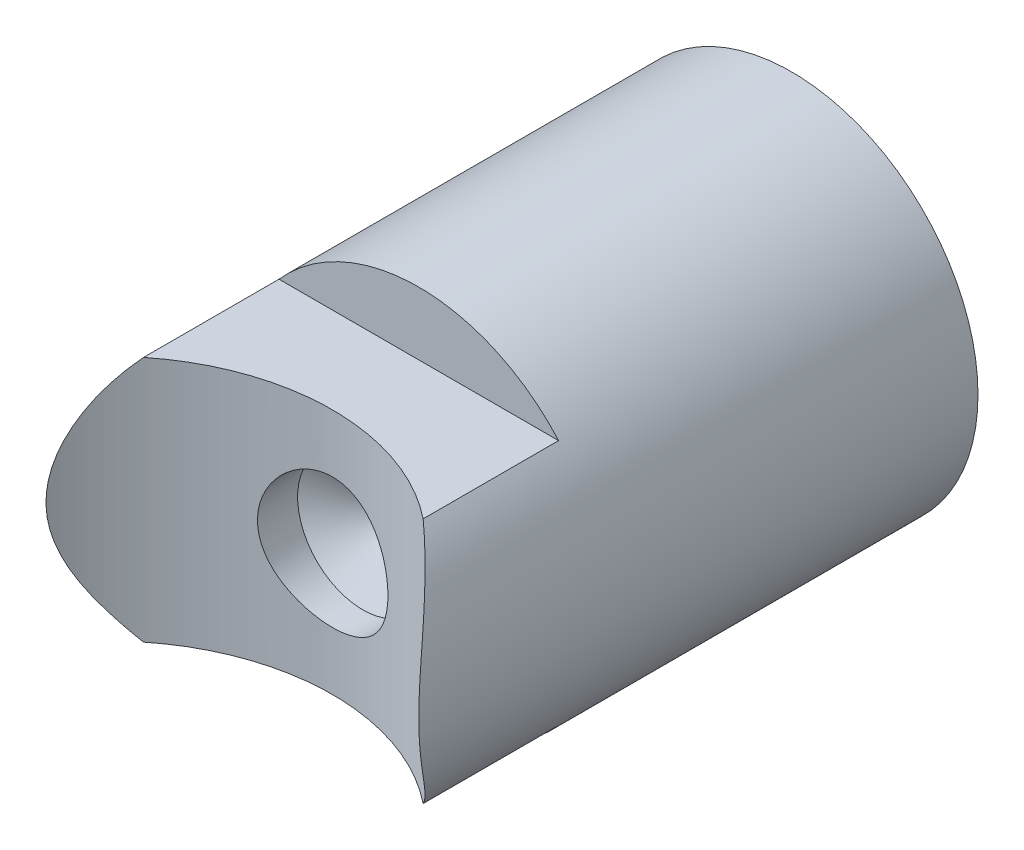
ISO-10303-21;
HEADER;
FILE_DESCRIPTION(('STEP AP214'),'2;1');
FILE_NAME('part.step','',(''),(''),'','','');
FILE_SCHEMA(('AUTOMOTIVE_DESIGN { 1 0 10303 214 1 1 1 1 }'));
ENDSEC;
DATA;
#1=APPLICATION_CONTEXT('core data for automotive mechanical design processes');
#2=APPLICATION_PROTOCOL_DEFINITION('international standard','automotive_design',2000,#1);
#3=PRODUCT_CONTEXT('',#1,'mechanical');
#4=PRODUCT('Part','Part','',(#3));
#5=PRODUCT_RELATED_PRODUCT_CATEGORY('part','',(#4));
#6=PRODUCT_DEFINITION_FORMATION('','',#4);
#7=PRODUCT_DEFINITION_CONTEXT('part definition',#1,'design');
#8=PRODUCT_DEFINITION('design','',#6,#7);
#9=PRODUCT_DEFINITION_SHAPE('','',#8);
#10=(LENGTH_UNIT() NAMED_UNIT(*) SI_UNIT(.MILLI.,.METRE.));
#11=(NAMED_UNIT(*) PLANE_ANGLE_UNIT() SI_UNIT($,.RADIAN.));
#12=(NAMED_UNIT(*) SI_UNIT($,.STERADIAN.) SOLID_ANGLE_UNIT());
#13=UNCERTAINTY_MEASURE_WITH_UNIT(LENGTH_MEASURE(1.E-05),#10,'distance_accuracy_value','');
#14=(GEOMETRIC_REPRESENTATION_CONTEXT(3) GLOBAL_UNCERTAINTY_ASSIGNED_CONTEXT((#13)) GLOBAL_UNIT_ASSIGNED_CONTEXT((#10,
#11,#12)) REPRESENTATION_CONTEXT('',''));
#15=CARTESIAN_POINT('',(0.,0.,0.));
#16=DIRECTION('',(0.,0.,1.));
#17=DIRECTION('',(1.,0.,0.));
#18=AXIS2_PLACEMENT_3D('',#15,#16,#17);
#19=CARTESIAN_POINT('',(0.,0.,-30.));
#20=DIRECTION('',(0.,0.,1.));
#21=DIRECTION('',(1.,0.,0.));
#22=AXIS2_PLACEMENT_3D('',#19,#20,#21);
#23=CYLINDRICAL_SURFACE('',#22,10.);
#24=DIRECTION('',(0.,0.,1.));
#25=VECTOR('',#24,1.);
#26=CARTESIAN_POINT('',(-7.5,-6.61437827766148,-10.));
#27=LINE('',#26,#25);
#28=CARTESIAN_POINT('',(-7.5,-6.61437827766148,-10.));
#29=VERTEX_POINT('',#28);
#30=CARTESIAN_POINT('',(-7.5,-6.61437827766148,-2.7342474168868));
#31=VERTEX_POINT('',#30);
#32=EDGE_CURVE('E81',#29,#31,#27,.T.);
#33=ORIENTED_EDGE('',*,*,#32,.T.);
#34=CARTESIAN_POINT('',(10.,0.,0.));
#35=CARTESIAN_POINT('',(9.9999981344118,0.176712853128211,-4.99587720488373E-06));
#36=CARTESIAN_POINT('',(9.99530247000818,0.353476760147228,-0.00709873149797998));
#37=CARTESIAN_POINT('',(9.97664304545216,0.705481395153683,-0.0350982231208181));
#38=CARTESIAN_POINT('',(9.96267330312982,0.880721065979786,-0.0560128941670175));
#39=CARTESIAN_POINT('',(9.92577451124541,1.22869680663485,-0.110642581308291));
#40=CARTESIAN_POINT('',(9.90282167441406,1.40142495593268,-0.144391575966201));
#41=CARTESIAN_POINT('',(9.84845326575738,1.7429570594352,-0.223152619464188));
#42=CARTESIAN_POINT('',(9.81703438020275,1.9117594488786,-0.268169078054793));
#43=CARTESIAN_POINT('',(9.73255865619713,2.30934953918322,-0.38704007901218));
#44=CARTESIAN_POINT('',(9.6758346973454,2.53603888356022,-0.465310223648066));
#45=CARTESIAN_POINT('',(9.54843738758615,2.9800614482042,-0.635770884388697));
#46=CARTESIAN_POINT('',(9.47775685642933,3.1973897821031,-0.727968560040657));
#47=CARTESIAN_POINT('',(9.32327405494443,3.62325806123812,-0.922678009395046));
#48=CARTESIAN_POINT('',(9.23943788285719,3.83177348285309,-1.02521617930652));
#49=CARTESIAN_POINT('',(9.05950548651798,4.239699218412,-1.2372470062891));
#50=CARTESIAN_POINT('',(8.96340983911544,4.43910996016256,-1.34673933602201));
#51=CARTESIAN_POINT('',(8.71395383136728,4.9161273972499,-1.61991602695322));
#52=CARTESIAN_POINT('',(8.55415175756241,5.18900174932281,-1.78601565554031));
#53=CARTESIAN_POINT('',(8.21054076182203,5.71719303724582,-2.12145050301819));
#54=CARTESIAN_POINT('',(8.02672152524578,5.97250235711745,-2.29078708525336));
#55=CARTESIAN_POINT('',(7.63550338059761,6.46513050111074,-2.6277271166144));
#56=CARTESIAN_POINT('',(7.42812627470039,6.70246562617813,-2.7953320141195));
#57=CARTESIAN_POINT('',(6.9897264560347,7.1584695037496,-3.12476629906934));
#58=CARTESIAN_POINT('',(6.75871276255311,7.37714531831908,-3.2865978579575));
#59=CARTESIAN_POINT('',(6.32459418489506,7.75003865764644,-3.56731115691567));
#60=CARTESIAN_POINT('',(6.12595824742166,7.90809198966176,-3.68802382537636));
#61=CARTESIAN_POINT('',(5.71419897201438,8.21055178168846,-3.92155607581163));
#62=CARTESIAN_POINT('',(5.50107860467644,8.3549610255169,-4.03437726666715));
#63=CARTESIAN_POINT('',(5.06095993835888,8.62865878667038,-4.25007115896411));
#64=CARTESIAN_POINT('',(4.83397905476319,8.75796570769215,-4.3529559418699));
#65=CARTESIAN_POINT('',(4.36658675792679,9.00011945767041,-4.54695165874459));
#66=CARTESIAN_POINT('',(4.12617779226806,9.11296927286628,-4.63806472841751));
#67=CARTESIAN_POINT('',(3.67565660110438,9.30260871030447,-4.79198651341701));
#68=CARTESIAN_POINT('',(3.4674872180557,9.38225988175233,-4.85696562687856));
#69=CARTESIAN_POINT('',(3.04361001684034,9.52820316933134,-4.97644025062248));
#70=CARTESIAN_POINT('',(2.82790373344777,9.59449798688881,-5.03093788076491));
#71=CARTESIAN_POINT('',(2.39013845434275,9.712807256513,-5.12844684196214));
#72=CARTESIAN_POINT('',(2.16808169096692,9.76482666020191,-5.17146215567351));
#73=CARTESIAN_POINT('',(1.71894272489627,9.85381348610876,-5.24517701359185));
#74=CARTESIAN_POINT('',(1.49186046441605,9.89078073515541,-5.27587641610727));
#75=CARTESIAN_POINT('',(1.03334285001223,9.94916253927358,-5.32440780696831));
#76=CARTESIAN_POINT('',(0.801893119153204,9.9705104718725,-5.3421846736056));
#77=CARTESIAN_POINT('',(0.337422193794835,9.99701217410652,-5.36425842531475));
#78=CARTESIAN_POINT('',(0.104400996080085,10.0021659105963,-5.36855528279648));
#79=CARTESIAN_POINT('',(-0.361280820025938,9.99618434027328,-5.36357078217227));
#80=CARTESIAN_POINT('',(-0.593941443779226,9.98504927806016,-5.35428962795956));
#81=CARTESIAN_POINT('',(-1.05699608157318,9.94669438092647,-5.32236065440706));
#82=CARTESIAN_POINT('',(-1.28739017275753,9.91947509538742,-5.29971329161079));
#83=CARTESIAN_POINT('',(-1.72871006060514,9.85180154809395,-5.24352038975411));
#84=CARTESIAN_POINT('',(-1.93990063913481,9.81236407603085,-5.21081317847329));
#85=CARTESIAN_POINT('',(-2.35755567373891,9.72047671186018,-5.1348004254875));
#86=CARTESIAN_POINT('',(-2.56401849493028,9.66802239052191,-5.09149127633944));
#87=CARTESIAN_POINT('',(-2.97097767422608,9.55081777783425,-4.99503543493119));
#88=CARTESIAN_POINT('',(-3.1714759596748,9.48607150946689,-4.94189196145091));
#89=CARTESIAN_POINT('',(-3.56575701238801,9.34501162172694,-4.82657559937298));
#90=CARTESIAN_POINT('',(-3.75953725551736,9.26869371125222,-4.76439936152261));
#91=CARTESIAN_POINT('',(-4.15581445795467,9.09832879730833,-4.62627469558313));
#92=CARTESIAN_POINT('',(-4.35764907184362,9.0033255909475,-4.54960443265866));
#93=CARTESIAN_POINT('',(-4.75191353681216,8.80161386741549,-4.38785706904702));
#94=CARTESIAN_POINT('',(-4.9443396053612,8.69490069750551,-4.30277662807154));
#95=CARTESIAN_POINT('',(-5.50696427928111,8.35848323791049,-4.0365811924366));
#96=CARTESIAN_POINT('',(-5.86249442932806,8.11250751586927,-3.84451742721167));
#97=CARTESIAN_POINT('',(-6.44429209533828,7.65313029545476,-3.4936747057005));
#98=CARTESIAN_POINT('',(-6.68003846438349,7.44805027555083,-3.33933899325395));
#99=CARTESIAN_POINT('',(-7.12910161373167,7.01941841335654,-3.02341680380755));
#100=CARTESIAN_POINT('',(-7.34240811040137,6.79585818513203,-2.86182705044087));
#101=CARTESIAN_POINT('',(-7.74671191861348,6.33115431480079,-2.5349654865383));
#102=CARTESIAN_POINT('',(-7.9376725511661,6.08998279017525,-2.36968813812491));
#103=CARTESIAN_POINT('',(-8.29678458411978,5.59087340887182,-2.03985302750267));
#104=CARTESIAN_POINT('',(-8.46494418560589,5.33294163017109,-1.87529502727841));
#105=CARTESIAN_POINT('',(-8.73643413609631,4.87094810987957,-1.5948763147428));
#106=CARTESIAN_POINT('',(-8.8451109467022,4.67080654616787,-1.4777053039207));
#107=CARTESIAN_POINT('',(-9.04965658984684,4.26100708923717,-1.24883448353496));
#108=CARTESIAN_POINT('',(-9.14552461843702,4.0513485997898,-1.13713501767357));
#109=CARTESIAN_POINT('',(-9.32364434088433,3.62262028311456,-0.922480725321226));
#110=CARTESIAN_POINT('',(-9.40592723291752,3.40357351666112,-0.819506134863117));
#111=CARTESIAN_POINT('',(-9.55619259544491,2.95551537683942,-0.62582707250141));
#112=CARTESIAN_POINT('',(-9.62418190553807,2.72650883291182,-0.535116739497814));
#113=CARTESIAN_POINT('',(-9.7656304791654,2.17676145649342,-0.341809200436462));
#114=CARTESIAN_POINT('',(-9.83278145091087,1.85179526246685,-0.246033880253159));
#115=CARTESIAN_POINT('',(-9.90935289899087,1.35386679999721,-0.134817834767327));
#116=CARTESIAN_POINT('',(-9.93084423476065,1.18626567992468,-0.103164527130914));
#117=CARTESIAN_POINT('',(-9.96539837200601,0.848317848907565,-0.0519431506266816));
#118=CARTESIAN_POINT('',(-9.97846145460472,0.677971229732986,-0.0323746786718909));
#119=CARTESIAN_POINT('',(-9.99589122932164,0.334568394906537,-0.00620920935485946));
#120=CARTESIAN_POINT('',(-10.0001932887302,0.161501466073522,0.000291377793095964));
#121=CARTESIAN_POINT('',(-9.99979337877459,-0.184594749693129,-0.000311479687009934));
#122=CARTESIAN_POINT('',(-9.99509162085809,-0.357624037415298,-0.00741460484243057));
#123=CARTESIAN_POINT('',(-9.97680250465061,-0.702302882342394,-0.0348594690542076));
#124=CARTESIAN_POINT('',(-9.96320684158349,-0.873950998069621,-0.0552135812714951));
#125=CARTESIAN_POINT('',(-9.92745178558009,-1.21451719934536,-0.108168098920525));
#126=CARTESIAN_POINT('',(-9.90528694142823,-1.38343347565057,-0.140776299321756));
#127=CARTESIAN_POINT('',(-9.8462534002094,-1.75956864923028,-0.22638830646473));
#128=CARTESIAN_POINT('',(-9.80708798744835,-1.96572747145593,-0.282459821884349));
#129=CARTESIAN_POINT('',(-9.7170341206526,-2.37116726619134,-0.408428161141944));
#130=CARTESIAN_POINT('',(-9.66613924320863,-2.57044440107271,-0.478332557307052));
#131=CARTESIAN_POINT('',(-9.55337873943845,-2.96219771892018,-0.629107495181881));
#132=CARTESIAN_POINT('',(-9.49148462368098,-3.15465464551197,-0.71000638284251));
#133=CARTESIAN_POINT('',(-9.35753338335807,-3.53223702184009,-0.879958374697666));
#134=CARTESIAN_POINT('',(-9.28547588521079,-3.71736220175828,-0.969011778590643));
#135=CARTESIAN_POINT('',(-9.08794529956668,-4.18390611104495,-1.20540808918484));
#136=CARTESIAN_POINT('',(-8.95541273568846,-4.46016120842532,-1.35707879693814));
#137=CARTESIAN_POINT('',(-8.66782328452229,-4.99613575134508,-1.66818536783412));
#138=CARTESIAN_POINT('',(-8.5127547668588,-5.25584655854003,-1.82762521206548));
#139=CARTESIAN_POINT('',(-8.18048009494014,-5.75941149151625,-2.14930654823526));
#140=CARTESIAN_POINT('',(-8.0032480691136,-6.00324657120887,-2.31155112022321));
#141=CARTESIAN_POINT('',(-7.62700877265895,-6.47453652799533,-2.63444737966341));
#142=CARTESIAN_POINT('',(-7.42800570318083,-6.70199455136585,-2.79509936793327));
#143=CARTESIAN_POINT('',(-7.00281100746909,-7.14544524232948,-3.11525144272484));
#144=CARTESIAN_POINT('',(-6.77605303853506,-7.36099433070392,-3.27461635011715));
#145=CARTESIAN_POINT('',(-6.29959586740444,-7.77265710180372,-3.58417717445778));
#146=CARTESIAN_POINT('',(-6.0498924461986,-7.96876719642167,-3.73437139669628));
#147=CARTESIAN_POINT('',(-5.52865638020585,-8.33881410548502,-4.02143206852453));
#148=CARTESIAN_POINT('',(-5.2571879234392,-8.51281247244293,-4.15833525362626));
#149=CARTESIAN_POINT('',(-4.69276057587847,-8.83649659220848,-4.41546148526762));
#150=CARTESIAN_POINT('',(-4.39981455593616,-8.98619673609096,-4.53569439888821));
#151=CARTESIAN_POINT('',(-3.89490087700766,-9.2129742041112,-4.71910966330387));
#152=CARTESIAN_POINT('',(-3.6883720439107,-9.29765373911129,-4.78797342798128));
#153=CARTESIAN_POINT('',(-3.26734492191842,-9.4538262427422,-4.91546431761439));
#154=CARTESIAN_POINT('',(-3.05284882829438,-9.52532281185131,-4.97409423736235));
#155=CARTESIAN_POINT('',(-2.61703380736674,-9.65415661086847,-5.08005048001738));
#156=CARTESIAN_POINT('',(-2.39571847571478,-9.71150116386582,-5.12738264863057));
#157=CARTESIAN_POINT('',(-1.94748453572,-9.81121861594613,-5.20985915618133));
#158=CARTESIAN_POINT('',(-1.72056574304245,-9.85359102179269,-5.24500309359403));
#159=CARTESIAN_POINT('',(-1.26161180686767,-9.92282468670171,-5.3024982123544));
#160=CARTESIAN_POINT('',(-1.0295571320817,-9.94960942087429,-5.3247862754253));
#161=CARTESIAN_POINT('',(-0.563234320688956,-9.98686507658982,-5.35580239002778));
#162=CARTESIAN_POINT('',(-0.328966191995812,-9.99733605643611,-5.36453049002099));
#163=CARTESIAN_POINT('',(0.139824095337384,-10.0017695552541,-5.36822503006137));
#164=CARTESIAN_POINT('',(0.374346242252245,-9.99573280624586,-5.3631920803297));
#165=CARTESIAN_POINT('',(0.84168805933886,-9.96726447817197,-5.33948188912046));
#166=CARTESIAN_POINT('',(1.07450779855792,-9.944833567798,-5.32080520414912));
#167=CARTESIAN_POINT('',(1.5196674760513,-9.88621639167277,-5.27208666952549));
#168=CARTESIAN_POINT('',(1.73225991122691,-9.85115610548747,-5.24297591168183));
#169=CARTESIAN_POINT('',(2.15311716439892,-9.7678103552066,-5.173933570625));
#170=CARTESIAN_POINT('',(2.3613804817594,-9.7195203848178,-5.13399830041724));
#171=CARTESIAN_POINT('',(2.77227365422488,-9.61039413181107,-5.04402418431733));
#172=CARTESIAN_POINT('',(2.97490524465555,-9.54956176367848,-4.99398849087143));
#173=CARTESIAN_POINT('',(3.37371603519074,-9.41606524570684,-4.88459838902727));
#174=CARTESIAN_POINT('',(3.56989279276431,-9.343396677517,-4.8252405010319));
#175=CARTESIAN_POINT('',(3.96885172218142,-9.18138547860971,-4.6935086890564));
#176=CARTESIAN_POINT('',(4.17109148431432,-9.09121873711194,-4.62050511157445));
#177=CARTESIAN_POINT('',(4.56655532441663,-8.89915447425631,-4.46592681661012));
#178=CARTESIAN_POINT('',(4.75977579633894,-8.79725231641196,-4.38434871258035));
#179=CARTESIAN_POINT('',(5.32525014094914,-8.47524529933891,-4.12838083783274));
#180=CARTESIAN_POINT('',(5.68335781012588,-8.23882303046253,-3.94274364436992));
#181=CARTESIAN_POINT('',(6.27073459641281,-7.7958818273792,-3.60205015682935));
#182=CARTESIAN_POINT('',(6.50922092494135,-7.59768756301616,-3.45167514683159));
#183=CARTESIAN_POINT('',(6.96427559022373,-7.18287032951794,-3.14296593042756));
#184=CARTESIAN_POINT('',(7.18083415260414,-6.9662392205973,-2.98462822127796));
#185=CARTESIAN_POINT('',(7.59220929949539,-6.51549611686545,-2.66334293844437));
#186=CARTESIAN_POINT('',(7.78698331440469,-6.28135133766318,-2.5003870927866));
#187=CARTESIAN_POINT('',(8.15425721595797,-5.79659759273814,-2.1740404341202));
#188=CARTESIAN_POINT('',(8.32676395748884,-5.54599372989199,-2.01064977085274));
#189=CARTESIAN_POINT('',(8.61422037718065,-5.0845027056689,-1.72301251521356));
#190=CARTESIAN_POINT('',(8.73353244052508,-4.87681493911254,-1.59797349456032));
#191=CARTESIAN_POINT('',(8.95806116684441,-4.45096698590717,-1.35303379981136));
#192=CARTESIAN_POINT('',(9.06327623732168,-4.23280561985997,-1.23313370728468));
#193=CARTESIAN_POINT('',(9.25878235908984,-3.78605771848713,-1.00204990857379));
#194=CARTESIAN_POINT('',(9.34910541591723,-3.5574949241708,-0.890847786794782));
#195=CARTESIAN_POINT('',(9.51407681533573,-3.08933560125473,-0.681128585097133));
#196=CARTESIAN_POINT('',(9.58873424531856,-2.84974556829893,-0.582604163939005));
#197=CARTESIAN_POINT('',(9.74224766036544,-2.2805139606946,-0.374624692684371));
#198=CARTESIAN_POINT('',(9.81481719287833,-1.9465682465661,-0.271742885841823));
#199=CARTESIAN_POINT('',(9.89812310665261,-1.43425213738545,-0.151257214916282));
#200=CARTESIAN_POINT('',(9.92161985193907,-1.2618088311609,-0.11675747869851));
#201=CARTESIAN_POINT('',(9.95968307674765,-0.913919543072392,-0.0604702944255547));
#202=CARTESIAN_POINT('',(9.97425565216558,-0.738475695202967,-0.0386741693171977));
#203=CARTESIAN_POINT('',(9.98944199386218,-0.468846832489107,-0.0158952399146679));
#204=CARTESIAN_POINT('',(9.9933973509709,-0.375236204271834,-0.00994489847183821));
#205=CARTESIAN_POINT('',(9.99867709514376,-0.187755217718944,-0.00199558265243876));
#206=CARTESIAN_POINT('',(10.0000009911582,-0.0938848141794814,2.65423252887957E-06));
#207=CARTESIAN_POINT('',(10.,0.,0.));
#208=B_SPLINE_CURVE_WITH_KNOTS('',3,(#34,#35,#36,#37,#38,#39,#40,#41,#42,#43,#44,#45,#46,#47,
#48,#49,#50,#51,#52,#53,#54,#55,#56,#57,#58,#59,#60,#61,#62,#63,#64,#65,#66,#67,#68,#69,#70,#71,
#72,#73,#74,#75,#76,#77,#78,#79,#80,#81,#82,#83,#84,#85,#86,#87,#88,#89,#90,#91,#92,#93,#94,#95,
#96,#97,#98,#99,#100,#101,#102,#103,#104,#105,#106,#107,#108,#109,#110,#111,#112,#113,#114,#115,
#116,#117,#118,#119,#120,#121,#122,#123,#124,#125,#126,#127,#128,#129,#130,#131,#132,#133,#134,
#135,#136,#137,#138,#139,#140,#141,#142,#143,#144,#145,#146,#147,#148,#149,#150,#151,#152,#153,
#154,#155,#156,#157,#158,#159,#160,#161,#162,#163,#164,#165,#166,#167,#168,#169,#170,#171,#172,
#173,#174,#175,#176,#177,#178,#179,#180,#181,#182,#183,#184,#185,#186,#187,#188,#189,#190,#191,
#192,#193,#194,#195,#196,#197,#198,#199,#200,#201,#202,#203,#204,#205,#206,#207),.UNSPECIFIED.,
.T.,.F.,(4,2,2,2,2,2,2,2,2,2,2,2,2,2,2,2,2,2,2,2,2,2,2,2,2,2,2,2,2,2,2,2,2,2,2,2,2,2,2,2,2,2,2,
2,2,2,2,2,2,2,2,2,2,2,2,2,2,2,2,2,2,2,2,2,2,2,2,2,2,2,2,2,2,2,2,2,2,2,2,2,2,2,2,2,2,2,4),(0.,
0.5300279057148,1.0603980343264,1.5921821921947,2.12417480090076,2.86228398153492,
3.60077389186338,4.34119910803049,5.08158949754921,6.15176083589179,7.22239330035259,
8.29204287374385,9.36128580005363,10.2038044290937,11.046150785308,11.8874597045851,
12.7286157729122,13.4244273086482,14.1200979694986,14.8155270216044,15.5109640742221,
16.2093504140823,16.9077381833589,17.6061154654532,18.3044688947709,18.9557077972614,
19.6071686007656,20.2584165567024,20.9099066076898,21.6168593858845,22.3240940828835,
23.7386144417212,24.7829542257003,25.8277705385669,26.8742784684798,27.9204089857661,
28.6882764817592,29.4561921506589,30.222319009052,30.9880784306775,32.0199203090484,
32.5351169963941,33.050296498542,33.5692630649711,34.0882174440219,34.6076570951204,
35.1274277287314,35.778019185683,36.4289677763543,37.0816276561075,37.7343115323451,
38.7584772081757,39.7831733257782,40.8090769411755,41.8347829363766,42.8867913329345,
43.9389935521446,44.9881994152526,46.0367815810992,46.7369210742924,47.4368690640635,
48.1364540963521,48.8360621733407,49.539076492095,50.2420882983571,50.9450689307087,
51.6480208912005,52.299562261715,52.95132583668,53.6028863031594,54.2546905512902,
54.9534553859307,55.6524972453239,57.0504431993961,58.0831649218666,59.116344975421,
60.1515099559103,61.1863555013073,61.9963814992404,62.8064989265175,63.6148519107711,
64.4227346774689,65.4888629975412,66.0205657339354,66.5519048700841,66.8334479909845,
67.1150436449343),.UNSPECIFIED.);
#209=CARTESIAN_POINT('',(-7.5,6.61437827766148,-2.7342474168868));
#210=VERTEX_POINT('',#209);
#211=EDGE_CURVE('E99',#210,#31,#208,.T.);
#212=ORIENTED_EDGE('',*,*,#211,.F.);
#213=DIRECTION('',(0.,0.,1.));
#214=VECTOR('',#213,1.);
#215=CARTESIAN_POINT('',(-7.5,6.61437827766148,-10.));
#216=LINE('',#215,#214);
#217=CARTESIAN_POINT('',(-7.5,6.61437827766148,-10.));
#218=VERTEX_POINT('',#217);
#219=EDGE_CURVE('E50',#218,#210,#216,.T.);
#220=ORIENTED_EDGE('',*,*,#219,.F.);
#221=CARTESIAN_POINT('',(0.,0.,-10.));
#222=DIRECTION('',(0.,0.,1.));
#223=DIRECTION('',(1.,0.,0.));
#224=AXIS2_PLACEMENT_3D('',#221,#222,#223);
#225=CIRCLE('',#224,10.);
#226=CARTESIAN_POINT('',(7.5,6.61437827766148,-10.));
#227=VERTEX_POINT('',#226);
#228=EDGE_CURVE('E88',#227,#218,#225,.T.);
#229=ORIENTED_EDGE('',*,*,#228,.F.);
#230=DIRECTION('',(0.,0.,1.));
#231=VECTOR('',#230,1.);
#232=CARTESIAN_POINT('',(7.5,6.61437827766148,-10.));
#233=LINE('',#232,#231);
#234=CARTESIAN_POINT('',(7.5,6.61437827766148,-2.7342474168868));
#235=VERTEX_POINT('',#234);
#236=EDGE_CURVE('E95',#227,#235,#233,.T.);
#237=ORIENTED_EDGE('',*,*,#236,.T.);
#238=CARTESIAN_POINT('',(7.5,-6.61437827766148,-2.7342474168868));
#239=VERTEX_POINT('',#238);
#240=EDGE_CURVE('E86',#239,#235,#208,.T.);
#241=ORIENTED_EDGE('',*,*,#240,.F.);
#242=DIRECTION('',(0.,0.,1.));
#243=VECTOR('',#242,1.);
#244=CARTESIAN_POINT('',(7.5,-6.61437827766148,-10.));
#245=LINE('',#244,#243);
#246=CARTESIAN_POINT('',(7.5,-6.61437827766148,-10.));
#247=VERTEX_POINT('',#246);
#248=EDGE_CURVE('E43',#247,#239,#245,.T.);
#249=ORIENTED_EDGE('',*,*,#248,.F.);
#250=CARTESIAN_POINT('',(0.,0.,-10.));
#251=DIRECTION('',(0.,0.,1.));
#252=DIRECTION('',(1.,0.,0.));
#253=AXIS2_PLACEMENT_3D('',#250,#251,#252);
#254=CIRCLE('',#253,10.);
#255=EDGE_CURVE('E74',#29,#247,#254,.T.);
#256=ORIENTED_EDGE('',*,*,#255,.F.);
#257=EDGE_LOOP('',(#33,#212,#220,#229,#237,#241,#249,#256));
#258=FACE_BOUND('',#257,.T.);
#259=CARTESIAN_POINT('',(0.,0.,-30.));
#260=DIRECTION('',(0.,0.,1.));
#261=DIRECTION('',(1.,0.,0.));
#262=AXIS2_PLACEMENT_3D('',#259,#260,#261);
#263=CIRCLE('',#262,10.);
#264=CARTESIAN_POINT('',(10.,0.,-30.));
#265=VERTEX_POINT('',#264);
#266=EDGE_CURVE('E125',#265,#265,#263,.T.);
#267=ORIENTED_EDGE('',*,*,#266,.T.);
#268=EDGE_LOOP('',(#267));
#269=FACE_BOUND('',#268,.T.);
#270=ADVANCED_FACE('F28',(#258,#269),#23,.T.);
#271=CARTESIAN_POINT('',(0.,0.,-30.));
#272=DIRECTION('',(0.,0.,1.));
#273=DIRECTION('',(1.,0.,0.));
#274=AXIS2_PLACEMENT_3D('',#271,#272,#273);
#275=PLANE('',#274);
#276=ORIENTED_EDGE('',*,*,#266,.F.);
#277=EDGE_LOOP('',(#276));
#278=FACE_BOUND('',#277,.T.);
#279=ADVANCED_FACE('F113',(#278),#275,.F.);
#280=CARTESIAN_POINT('',(0.,-17.,6.6332495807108));
#281=DIRECTION('',(0.,1.,0.));
#282=DIRECTION('',(0.,0.,1.));
#283=AXIS2_PLACEMENT_3D('',#280,#281,#282);
#284=CYLINDRICAL_SURFACE('',#283,12.);
#285=ORIENTED_EDGE('',*,*,#211,.T.);
#286=CARTESIAN_POINT('',(0.,-6.61437827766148,6.6332495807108));
#287=DIRECTION('',(0.,1.,0.));
#288=DIRECTION('',(0.,0.,1.));
#289=AXIS2_PLACEMENT_3D('',#286,#287,#288);
#290=CIRCLE('',#289,12.);
#291=EDGE_CURVE('E11',#31,#239,#290,.F.);
#292=ORIENTED_EDGE('',*,*,#291,.T.);
#293=ORIENTED_EDGE('',*,*,#240,.T.);
#294=CARTESIAN_POINT('',(0.,6.61437827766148,6.6332495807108));
#295=DIRECTION('',(0.,-1.,0.));
#296=DIRECTION('',(0.,0.,-1.));
#297=AXIS2_PLACEMENT_3D('',#294,#295,#296);
#298=CIRCLE('',#297,12.);
#299=EDGE_CURVE('E36',#235,#210,#298,.F.);
#300=ORIENTED_EDGE('',*,*,#299,.T.);
#301=EDGE_LOOP('',(#285,#292,#293,#300));
#302=FACE_BOUND('',#301,.T.);
#303=CARTESIAN_POINT('',(3.50000569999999,0.,-4.84498896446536));
#304=CARTESIAN_POINT('',(3.50000266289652,0.192054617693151,-4.84499138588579));
#305=CARTESIAN_POINT('',(3.48414408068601,0.384139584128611,-4.84986191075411));
#306=CARTESIAN_POINT('',(3.42128076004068,0.76271149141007,-4.86874514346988));
#307=CARTESIAN_POINT('',(3.37426429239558,0.94919629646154,-4.882761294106));
#308=CARTESIAN_POINT('',(3.25080315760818,1.31103399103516,-4.91821624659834));
#309=CARTESIAN_POINT('',(3.17440544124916,1.48640412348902,-4.93964320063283));
#310=CARTESIAN_POINT('',(2.99450303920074,1.82187757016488,-4.98748969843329));
#311=CARTESIAN_POINT('',(2.89099478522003,1.98197887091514,-5.01390989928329));
#312=CARTESIAN_POINT('',(2.65649556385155,2.28715883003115,-5.06965216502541));
#313=CARTESIAN_POINT('',(2.52483621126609,2.43171320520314,-5.09903344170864));
#314=CARTESIAN_POINT('',(2.23920583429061,2.69703547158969,-5.1568801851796));
#315=CARTESIAN_POINT('',(2.08523209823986,2.81780046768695,-5.18534554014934));
#316=CARTESIAN_POINT('',(1.75563851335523,3.03436890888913,-5.23882269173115));
#317=CARTESIAN_POINT('',(1.57965594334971,3.12964125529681,-5.26375656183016));
#318=CARTESIAN_POINT('',(1.21331774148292,3.28903910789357,-5.30667566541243));
#319=CARTESIAN_POINT('',(1.02296504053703,3.35317094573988,-5.32466231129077));
#320=CARTESIAN_POINT('',(0.638771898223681,3.4467422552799,-5.35124147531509));
#321=CARTESIAN_POINT('',(0.445166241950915,3.47707585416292,-5.3600756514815));
#322=CARTESIAN_POINT('',(0.0554256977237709,3.50501318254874,-5.36820394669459));
#323=CARTESIAN_POINT('',(-0.140708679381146,3.50262342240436,-5.36749996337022));
#324=CARTESIAN_POINT('',(-0.523679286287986,3.46578972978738,-5.35680371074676));
#325=CARTESIAN_POINT('',(-0.710617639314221,3.43231345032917,-5.34709184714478));
#326=CARTESIAN_POINT('',(-1.07609770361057,3.33583311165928,-5.31980925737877));
#327=CARTESIAN_POINT('',(-1.25463889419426,3.27282722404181,-5.3022380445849));
#328=CARTESIAN_POINT('',(-1.60060064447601,3.11839890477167,-5.26081611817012));
#329=CARTESIAN_POINT('',(-1.76787372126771,3.02666515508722,-5.23689706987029));
#330=CARTESIAN_POINT('',(-2.08496703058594,2.81762930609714,-5.18532720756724));
#331=CARTESIAN_POINT('',(-2.23478329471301,2.70032141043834,-5.15767554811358));
#332=CARTESIAN_POINT('',(-2.51848658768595,2.43841700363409,-5.10041783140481));
#333=CARTESIAN_POINT('',(-2.65159212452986,2.29298040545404,-5.07077727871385));
#334=CARTESIAN_POINT('',(-2.8917376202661,1.98155523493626,-5.01377268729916));
#335=CARTESIAN_POINT('',(-2.99877527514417,1.81556484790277,-4.98640884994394));
#336=CARTESIAN_POINT('',(-3.18450254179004,1.46578208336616,-4.93689743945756));
#337=CARTESIAN_POINT('',(-3.26293965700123,1.28184849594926,-4.91479689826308));
#338=CARTESIAN_POINT('',(-3.38750241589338,0.90259190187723,-4.87887783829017));
#339=CARTESIAN_POINT('',(-3.43363792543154,0.707272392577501,-4.86505679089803));
#340=CARTESIAN_POINT('',(-3.49085698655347,0.318193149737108,-4.84781242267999));
#341=CARTESIAN_POINT('',(-3.50312275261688,0.124622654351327,-4.84403858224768));
#342=CARTESIAN_POINT('',(-3.49554416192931,-0.261812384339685,-4.84634927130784));
#343=CARTESIAN_POINT('',(-3.47570400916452,-0.454677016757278,-4.85243251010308));
#344=CARTESIAN_POINT('',(-3.4055270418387,-0.829394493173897,-4.87342927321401));
#345=CARTESIAN_POINT('',(-3.35593818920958,-1.0114007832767,-4.88812602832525));
#346=CARTESIAN_POINT('',(-3.22853182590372,-1.36450203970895,-4.92447259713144));
#347=CARTESIAN_POINT('',(-3.15071012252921,-1.53559538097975,-4.94612344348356));
#348=CARTESIAN_POINT('',(-2.96676424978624,-1.86685814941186,-4.99462866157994));
#349=CARTESIAN_POINT('',(-2.85996617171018,-2.02663549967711,-5.02160211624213));
#350=CARTESIAN_POINT('',(-2.62190840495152,-2.32643361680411,-5.07745138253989));
#351=CARTESIAN_POINT('',(-2.49064318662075,-2.46644990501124,-5.10632762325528));
#352=CARTESIAN_POINT('',(-2.20184224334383,-2.72785323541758,-5.16396576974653));
#353=CARTESIAN_POINT('',(-2.04354117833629,-2.84840557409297,-5.19268745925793));
#354=CARTESIAN_POINT('',(-1.70827993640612,-3.06124737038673,-5.24574616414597));
#355=CARTESIAN_POINT('',(-1.53132071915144,-3.15353828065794,-5.27008340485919));
#356=CARTESIAN_POINT('',(-1.16497239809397,-3.30635069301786,-5.31147827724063));
#357=CARTESIAN_POINT('',(-0.975689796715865,-3.3671119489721,-5.32859065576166));
#358=CARTESIAN_POINT('',(-0.589015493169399,-3.45578017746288,-5.35384956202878));
#359=CARTESIAN_POINT('',(-0.391625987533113,-3.48369598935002,-5.36199850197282));
#360=CARTESIAN_POINT('',(-0.00207563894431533,-3.50523885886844,-5.36827398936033));
#361=CARTESIAN_POINT('',(0.190013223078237,-3.50007975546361,-5.36675534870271));
#362=CARTESIAN_POINT('',(0.570471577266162,-3.45849929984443,-5.35469377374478));
#363=CARTESIAN_POINT('',(0.758841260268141,-3.42207955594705,-5.34415130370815));
#364=CARTESIAN_POINT('',(1.12475399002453,-3.31974747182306,-5.3153201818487));
#365=CARTESIAN_POINT('',(1.30238405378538,-3.25412346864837,-5.29710735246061));
#366=CARTESIAN_POINT('',(1.64420864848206,-3.09550258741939,-5.25482314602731));
#367=CARTESIAN_POINT('',(1.80840103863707,-3.00250135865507,-5.23075083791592));
#368=CARTESIAN_POINT('',(2.12416192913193,-2.78845204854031,-5.17836980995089));
#369=CARTESIAN_POINT('',(2.2751884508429,-2.66663090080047,-5.14995375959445));
#370=CARTESIAN_POINT('',(2.55506275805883,-2.39981093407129,-5.09245333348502));
#371=CARTESIAN_POINT('',(2.68390428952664,-2.25480560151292,-5.06336877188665));
#372=CARTESIAN_POINT('',(2.91932461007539,-1.94090814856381,-5.00688074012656));
#373=CARTESIAN_POINT('',(3.02518766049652,-1.77146551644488,-4.97954617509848));
#374=CARTESIAN_POINT('',(3.20679257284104,-1.41641497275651,-4.93071937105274));
#375=CARTESIAN_POINT('',(3.28255032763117,-1.23081565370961,-4.90922405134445));
#376=CARTESIAN_POINT('',(3.39414784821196,-0.872147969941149,-4.87686362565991));
#377=CARTESIAN_POINT('',(3.43373958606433,-0.700327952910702,-4.8650191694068));
#378=CARTESIAN_POINT('',(3.48666761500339,-0.352346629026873,-4.84908140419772));
#379=CARTESIAN_POINT('',(3.50000848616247,-0.176186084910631,-4.84498674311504));
#380=CARTESIAN_POINT('',(3.50000569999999,0.,-4.84498896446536));
#381=B_SPLINE_CURVE_WITH_KNOTS('',3,(#303,#304,#305,#306,#307,#308,#309,#310,#311,#312,#313,
#314,#315,#316,#317,#318,#319,#320,#321,#322,#323,#324,#325,#326,#327,#328,#329,#330,#331,#332,
#333,#334,#335,#336,#337,#338,#339,#340,#341,#342,#343,#344,#345,#346,#347,#348,#349,#350,#351,
#352,#353,#354,#355,#356,#357,#358,#359,#360,#361,#362,#363,#364,#365,#366,#367,#368,#369,#370,
#371,#372,#373,#374,#375,#376,#377,#378,#379,#380),.UNSPECIFIED.,.T.,.F.,(4,2,2,2,2,2,2,2,2,2,2,
2,2,2,2,2,2,2,2,2,2,2,2,2,2,2,2,2,2,2,2,2,2,2,2,2,2,2,4),(0.,0.57551448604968,1.15124574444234,
1.72606079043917,2.30095153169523,2.8914118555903,3.4819439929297,4.08396020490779,
4.68585396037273,5.27141589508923,5.85686133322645,6.42467291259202,6.99251965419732,
7.56674638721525,8.14110340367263,8.7364347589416,9.33181871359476,9.93233848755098,
10.5326747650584,11.1117744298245,11.6907982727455,12.2558405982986,12.8209668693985,
13.4005688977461,13.9803020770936,14.5805530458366,15.1807731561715,15.7763596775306,
16.3717858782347,16.9454884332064,17.5191614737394,18.0872920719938,18.655513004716,
19.2411701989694,19.8269922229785,20.4290455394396,21.0307806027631,21.558835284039,
22.0867978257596),.UNSPECIFIED.);
#382=CARTESIAN_POINT('',(3.50000569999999,0.,-4.84498896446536));
#383=VERTEX_POINT('',#382);
#384=EDGE_CURVE('E97',#383,#383,#381,.T.);
#385=ORIENTED_EDGE('',*,*,#384,.F.);
#386=EDGE_LOOP('',(#385));
#387=FACE_BOUND('',#386,.T.);
#388=ADVANCED_FACE('F107',(#302,#387),#284,.F.);
#389=CARTESIAN_POINT('',(0.,0.,-7.));
#390=DIRECTION('',(0.,0.,1.));
#391=DIRECTION('',(1.,0.,0.));
#392=AXIS2_PLACEMENT_3D('',#389,#390,#391);
#393=CONICAL_SURFACE('',#392,3.5000057,1.02974425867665);
#394=CARTESIAN_POINT('',(0.,0.,-9.10301559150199));
#395=VERTEX_POINT('',#394);
#396=VERTEX_LOOP('',#395);
#397=FACE_BOUND('',#396,.T.);
#398=CARTESIAN_POINT('',(0.,0.,-7.));
#399=DIRECTION('',(0.,0.,1.));
#400=DIRECTION('',(1.,0.,0.));
#401=AXIS2_PLACEMENT_3D('',#398,#399,#400);
#402=CIRCLE('',#401,3.5000057);
#403=CARTESIAN_POINT('',(3.5000057,0.,-7.));
#404=VERTEX_POINT('',#403);
#405=EDGE_CURVE('E105',#404,#404,#402,.T.);
#406=ORIENTED_EDGE('',*,*,#405,.T.);
#407=EDGE_LOOP('',(#406));
#408=FACE_BOUND('',#407,.T.);
#409=ADVANCED_FACE('F112',(#397,#408),#393,.F.);
#410=CARTESIAN_POINT('',(0.,0.,0.));
#411=DIRECTION('',(0.,0.,1.));
#412=DIRECTION('',(1.,0.,0.));
#413=AXIS2_PLACEMENT_3D('',#410,#411,#412);
#414=CYLINDRICAL_SURFACE('',#413,3.50000569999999);
#415=ORIENTED_EDGE('',*,*,#384,.T.);
#416=EDGE_LOOP('',(#415));
#417=FACE_BOUND('',#416,.T.);
#418=ORIENTED_EDGE('',*,*,#405,.F.);
#419=EDGE_LOOP('',(#418));
#420=FACE_BOUND('',#419,.T.);
#421=ADVANCED_FACE('F117',(#417,#420),#414,.F.);
#422=CARTESIAN_POINT('',(-7.5,6.61437827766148,-10.));
#423=DIRECTION('',(0.,-1.,0.));
#424=DIRECTION('',(0.,0.,-1.));
#425=AXIS2_PLACEMENT_3D('',#422,#423,#424);
#426=PLANE('',#425);
#427=ORIENTED_EDGE('',*,*,#236,.F.);
#428=DIRECTION('',(1.,0.,0.));
#429=VECTOR('',#428,1.);
#430=CARTESIAN_POINT('',(-7.5,6.61437827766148,-10.));
#431=LINE('',#430,#429);
#432=EDGE_CURVE('E92',#218,#227,#431,.T.);
#433=ORIENTED_EDGE('',*,*,#432,.F.);
#434=ORIENTED_EDGE('',*,*,#219,.T.);
#435=ORIENTED_EDGE('',*,*,#299,.F.);
#436=EDGE_LOOP('',(#427,#433,#434,#435));
#437=FACE_BOUND('',#436,.T.);
#438=ADVANCED_FACE('F115',(#437),#426,.F.);
#439=CARTESIAN_POINT('',(0.,0.,-10.));
#440=DIRECTION('',(0.,0.,1.));
#441=DIRECTION('',(1.,0.,0.));
#442=AXIS2_PLACEMENT_3D('',#439,#440,#441);
#443=PLANE('',#442);
#444=ORIENTED_EDGE('',*,*,#228,.T.);
#445=ORIENTED_EDGE('',*,*,#432,.T.);
#446=EDGE_LOOP('',(#444,#445));
#447=FACE_BOUND('',#446,.T.);
#448=ADVANCED_FACE('F139',(#447),#443,.T.);
#449=CARTESIAN_POINT('',(7.5,-6.61437827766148,-10.));
#450=DIRECTION('',(0.,1.,0.));
#451=DIRECTION('',(0.,0.,1.));
#452=AXIS2_PLACEMENT_3D('',#449,#450,#451);
#453=PLANE('',#452);
#454=ORIENTED_EDGE('',*,*,#32,.F.);
#455=DIRECTION('',(-1.,0.,0.));
#456=VECTOR('',#455,1.);
#457=CARTESIAN_POINT('',(7.5,-6.61437827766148,-10.));
#458=LINE('',#457,#456);
#459=EDGE_CURVE('E76',#247,#29,#458,.T.);
#460=ORIENTED_EDGE('',*,*,#459,.F.);
#461=ORIENTED_EDGE('',*,*,#248,.T.);
#462=ORIENTED_EDGE('',*,*,#291,.F.);
#463=EDGE_LOOP('',(#454,#460,#461,#462));
#464=FACE_BOUND('',#463,.T.);
#465=ADVANCED_FACE('F80',(#464),#453,.F.);
#466=CARTESIAN_POINT('',(0.,0.,-10.));
#467=DIRECTION('',(0.,0.,1.));
#468=DIRECTION('',(1.,0.,0.));
#469=AXIS2_PLACEMENT_3D('',#466,#467,#468);
#470=PLANE('',#469);
#471=ORIENTED_EDGE('',*,*,#255,.T.);
#472=ORIENTED_EDGE('',*,*,#459,.T.);
#473=EDGE_LOOP('',(#471,#472));
#474=FACE_BOUND('',#473,.T.);
#475=ADVANCED_FACE('F75',(#474),#470,.T.);
#476=CLOSED_SHELL('',(#270,#279,#388,#409,#421,#438,#448,#465,#475));
#477=MANIFOLD_SOLID_BREP('B2',#476);
#478=ADVANCED_BREP_SHAPE_REPRESENTATION('',(#18,#477),#14);
#479=SHAPE_DEFINITION_REPRESENTATION(#9,#478);
ENDSEC;
END-ISO-10303-21;
